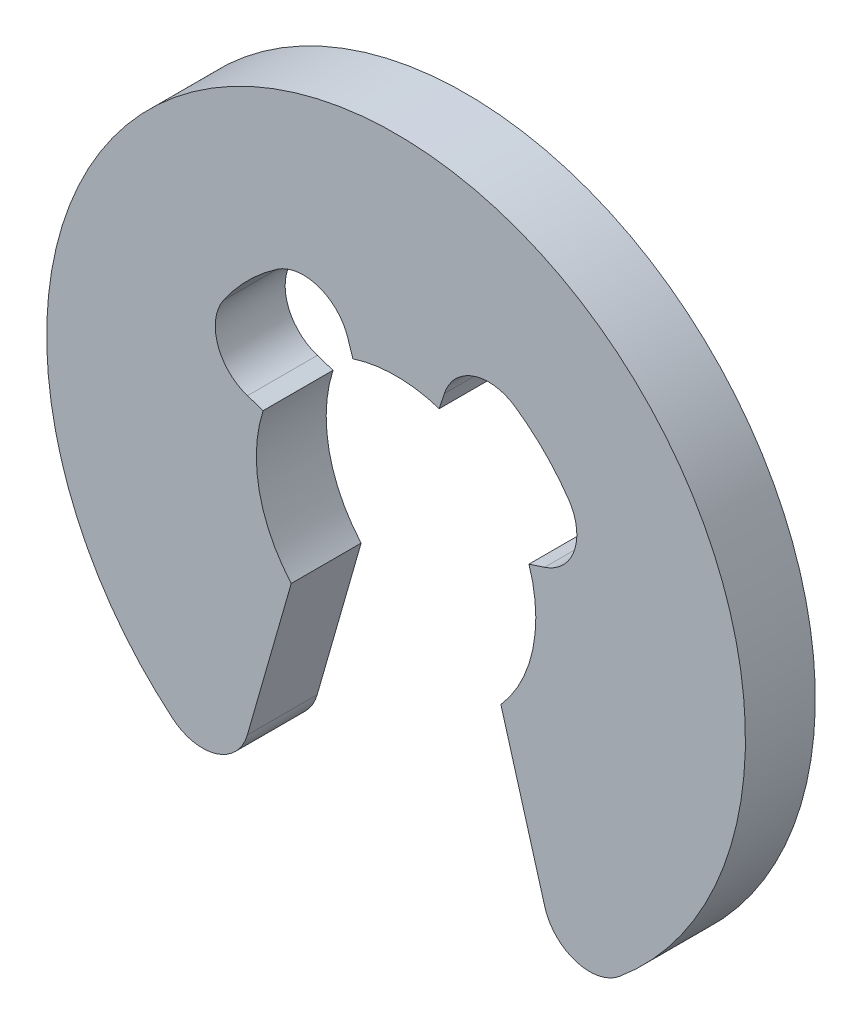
from build123d import *

# Parameters (mm, degrees)
BODY_DEPTH = 0.3


with BuildPart() as part:
    # Sketch1 → Body (new body)
    with BuildSketch(Plane.XY):
        with BuildLine():
            Line((0.207294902, 0.637988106), (0.185410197, 0.57063391))
            ThreePointArc((0.185410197, 0.57063391), (0, 0.6), (-0.185410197, 0.57063391))
            Line((-0.185410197, 0.57063391), (-0.207294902, 0.637988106))
            ThreePointArc((-0.207294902, 0.637988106), (-0.333386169, 0.76562763), (-0.511079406, 0.74080891))
            ThreePointArc((-0.511079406, 0.74080891), (-0.636396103, 0.636396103), (-0.74080891, 0.511079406))
            ThreePointArc((-0.74080891, 0.511079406), (-0.76562763, 0.333386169), (-0.637988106, 0.207294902))
            Line((-0.637988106, 0.207294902), (-0.57063391, 0.185410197))
            ThreePointArc((-0.57063391, 0.185410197), (-0.587523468, -0.121721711), (-0.45, -0.396862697))
            Line((-0.45, -0.396862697), (-0.638688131, -1.054896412))
            ThreePointArc((-0.638688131, -1.054896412), (-0.772017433, -1.190892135), (-0.958777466, -1.153579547))
            ThreePointArc((-0.958777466, -1.153579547), (0, 1.5), (0.958777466, -1.153579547))
            ThreePointArc((0.958777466, -1.153579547), (0.772017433, -1.190892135), (0.638688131, -1.054896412))
            Line((0.638688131, -1.054896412), (0.45, -0.396862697))
            ThreePointArc((0.45, -0.396862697), (0.587523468, -0.121721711), (0.57063391, 0.185410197))
            Line((0.57063391, 0.185410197), (0.637988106, 0.207294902))
            ThreePointArc((0.637988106, 0.207294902), (0.76562763, 0.333386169), (0.74080891, 0.511079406))
            ThreePointArc((0.74080891, 0.511079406), (0.636396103, 0.636396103), (0.511079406, 0.74080891))
            ThreePointArc((0.511079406, 0.74080891), (0.333386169, 0.76562763), (0.207294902, 0.637988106))
        make_face()
    extrude(amount=-BODY_DEPTH)


solid = part.part
